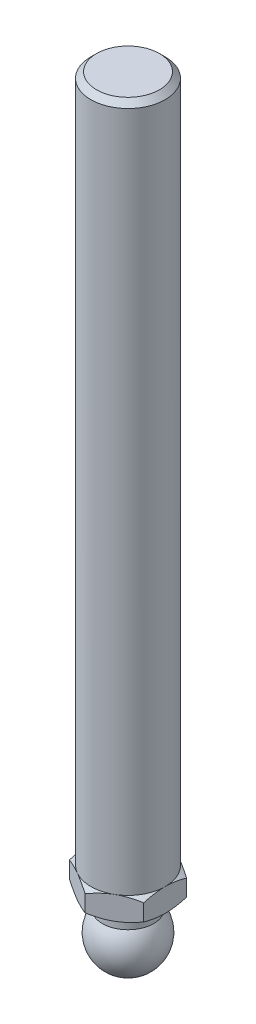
ISO-10303-21;
HEADER;
FILE_DESCRIPTION(('STEP AP214'),'2;1');
FILE_NAME('part.step','',(''),(''),'','','');
FILE_SCHEMA(('AUTOMOTIVE_DESIGN { 1 0 10303 214 1 1 1 1 }'));
ENDSEC;
DATA;
#1=APPLICATION_CONTEXT('core data for automotive mechanical design processes');
#2=APPLICATION_PROTOCOL_DEFINITION('international standard','automotive_design',2000,#1);
#3=PRODUCT_CONTEXT('',#1,'mechanical');
#4=PRODUCT('Part','Part','',(#3));
#5=PRODUCT_RELATED_PRODUCT_CATEGORY('part','',(#4));
#6=PRODUCT_DEFINITION_FORMATION('','',#4);
#7=PRODUCT_DEFINITION_CONTEXT('part definition',#1,'design');
#8=PRODUCT_DEFINITION('design','',#6,#7);
#9=PRODUCT_DEFINITION_SHAPE('','',#8);
#10=(LENGTH_UNIT() NAMED_UNIT(*) SI_UNIT(.MILLI.,.METRE.));
#11=(NAMED_UNIT(*) PLANE_ANGLE_UNIT() SI_UNIT($,.RADIAN.));
#12=(NAMED_UNIT(*) SI_UNIT($,.STERADIAN.) SOLID_ANGLE_UNIT());
#13=UNCERTAINTY_MEASURE_WITH_UNIT(LENGTH_MEASURE(1.E-05),#10,'distance_accuracy_value','');
#14=(GEOMETRIC_REPRESENTATION_CONTEXT(3) GLOBAL_UNCERTAINTY_ASSIGNED_CONTEXT((#13)) GLOBAL_UNIT_ASSIGNED_CONTEXT((#10,
#11,#12)) REPRESENTATION_CONTEXT('',''));
#15=CARTESIAN_POINT('',(0.,0.,0.));
#16=DIRECTION('',(0.,0.,1.));
#17=DIRECTION('',(1.,0.,0.));
#18=AXIS2_PLACEMENT_3D('',#15,#16,#17);
#19=CARTESIAN_POINT('',(0.,7.,0.));
#20=DIRECTION('',(0.,-1.,0.));
#21=DIRECTION('',(-1.,0.,0.));
#22=AXIS2_PLACEMENT_3D('',#19,#20,#21);
#23=SPHERICAL_SURFACE('',#22,7.);
#24=CARTESIAN_POINT('',(-9.71445146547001E-13,0.,0.));
#25=VERTEX_POINT('',#24);
#26=VERTEX_LOOP('',#25);
#27=FACE_BOUND('',#26,.T.);
#28=CARTESIAN_POINT('',(0.,11.3301270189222,0.));
#29=DIRECTION('',(0.,-1.,0.));
#30=DIRECTION('',(0.,0.,-1.));
#31=AXIS2_PLACEMENT_3D('',#28,#29,#30);
#32=CIRCLE('',#31,5.5);
#33=CARTESIAN_POINT('',(0.,11.3301270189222,-5.5));
#34=VERTEX_POINT('',#33);
#35=EDGE_CURVE('E9',#34,#34,#32,.T.);
#36=ORIENTED_EDGE('',*,*,#35,.T.);
#37=EDGE_LOOP('',(#36));
#38=FACE_BOUND('',#37,.T.);
#39=ADVANCED_FACE('F14',(#27,#38),#23,.T.);
#40=CARTESIAN_POINT('',(0.,0.,0.));
#41=DIRECTION('',(0.,-1.,0.));
#42=DIRECTION('',(0.,0.,-1.));
#43=AXIS2_PLACEMENT_3D('',#40,#41,#42);
#44=CYLINDRICAL_SURFACE('',#43,5.5);
#45=ORIENTED_EDGE('',*,*,#35,.F.);
#46=EDGE_LOOP('',(#45));
#47=FACE_BOUND('',#46,.T.);
#48=CARTESIAN_POINT('',(0.,14.5,0.));
#49=DIRECTION('',(0.,-1.,0.));
#50=DIRECTION('',(0.,0.,-1.));
#51=AXIS2_PLACEMENT_3D('',#48,#49,#50);
#52=CIRCLE('',#51,5.5);
#53=CARTESIAN_POINT('',(0.,14.5,-5.5));
#54=VERTEX_POINT('',#53);
#55=EDGE_CURVE('E146',#54,#54,#52,.T.);
#56=ORIENTED_EDGE('',*,*,#55,.T.);
#57=EDGE_LOOP('',(#56));
#58=FACE_BOUND('',#57,.T.);
#59=ADVANCED_FACE('F251',(#47,#58),#44,.T.);
#60=CARTESIAN_POINT('',(8.,14.5,0.));
#61=DIRECTION('',(0.,1.,0.));
#62=DIRECTION('',(0.,0.,1.));
#63=AXIS2_PLACEMENT_3D('',#60,#61,#62);
#64=PLANE('',#63);
#65=ORIENTED_EDGE('',*,*,#55,.F.);
#66=EDGE_LOOP('',(#65));
#67=FACE_BOUND('',#66,.T.);
#68=CARTESIAN_POINT('',(0.,14.5,0.));
#69=DIRECTION('',(0.,-1.,0.));
#70=DIRECTION('',(0.,0.,-1.));
#71=AXIS2_PLACEMENT_3D('',#68,#69,#70);
#72=CIRCLE('',#71,8.);
#73=CARTESIAN_POINT('',(4.,14.5,-6.92820323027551));
#74=VERTEX_POINT('',#73);
#75=CARTESIAN_POINT('',(8.,14.5,0.));
#76=VERTEX_POINT('',#75);
#77=EDGE_CURVE('E145',#74,#76,#72,.T.);
#78=ORIENTED_EDGE('',*,*,#77,.T.);
#79=CARTESIAN_POINT('',(4.,14.5,6.92820323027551));
#80=VERTEX_POINT('',#79);
#81=EDGE_CURVE('E141',#76,#80,#72,.T.);
#82=ORIENTED_EDGE('',*,*,#81,.T.);
#83=CARTESIAN_POINT('',(-4.,14.5,6.92820323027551));
#84=VERTEX_POINT('',#83);
#85=EDGE_CURVE('E144',#80,#84,#72,.T.);
#86=ORIENTED_EDGE('',*,*,#85,.T.);
#87=CARTESIAN_POINT('',(-8.,14.5,0.));
#88=VERTEX_POINT('',#87);
#89=EDGE_CURVE('E212',#84,#88,#72,.T.);
#90=ORIENTED_EDGE('',*,*,#89,.T.);
#91=CARTESIAN_POINT('',(-4.,14.5,-6.92820323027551));
#92=VERTEX_POINT('',#91);
#93=EDGE_CURVE('E215',#88,#92,#72,.T.);
#94=ORIENTED_EDGE('',*,*,#93,.T.);
#95=EDGE_CURVE('E220',#92,#74,#72,.T.);
#96=ORIENTED_EDGE('',*,*,#95,.T.);
#97=EDGE_LOOP('',(#78,#82,#86,#90,#94,#96));
#98=FACE_BOUND('',#97,.T.);
#99=ADVANCED_FACE('F222',(#67,#98),#64,.F.);
#100=CARTESIAN_POINT('',(0.,17.,0.));
#101=DIRECTION('',(0.,1.,0.));
#102=DIRECTION('',(0.,0.,1.));
#103=AXIS2_PLACEMENT_3D('',#100,#101,#102);
#104=CONICAL_SURFACE('',#103,12.3301270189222,1.0471975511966);
#105=CARTESIAN_POINT('',(-8.,19.285548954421,-14.1889203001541));
#106=CARTESIAN_POINT('',(-8.,19.1157216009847,-13.851186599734));
#107=CARTESIAN_POINT('',(-8.,18.9470198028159,-13.5128811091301));
#108=CARTESIAN_POINT('',(-8.,18.6124136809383,-12.8348638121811));
#109=CARTESIAN_POINT('',(-8.,18.446509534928,-12.4951519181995));
#110=CARTESIAN_POINT('',(-8.,18.1177477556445,-11.8134403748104));
#111=CARTESIAN_POINT('',(-8.,17.9548966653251,-11.4714375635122));
#112=CARTESIAN_POINT('',(-8.,17.6333333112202,-10.7854960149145));
#113=CARTESIAN_POINT('',(-8.,17.4746209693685,-10.4415573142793));
#114=CARTESIAN_POINT('',(-8.,17.1550497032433,-9.7353527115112));
#115=CARTESIAN_POINT('',(-8.,16.9944328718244,-9.37297690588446));
#116=CARTESIAN_POINT('',(-8.,16.680226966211,-8.64516064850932));
#117=CARTESIAN_POINT('',(-8.,16.5266382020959,-8.27972006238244));
#118=CARTESIAN_POINT('',(-8.,16.2285062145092,-7.54540420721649));
#119=CARTESIAN_POINT('',(-8.,16.0839575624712,-7.17653115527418));
#120=CARTESIAN_POINT('',(-8.,15.8063691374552,-6.43449862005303));
#121=CARTESIAN_POINT('',(-8.,15.6733281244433,-6.06133960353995));
#122=CARTESIAN_POINT('',(-8.,15.394180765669,-5.22677195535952));
#123=CARTESIAN_POINT('',(-8.,15.2517108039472,-4.7641292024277));
#124=CARTESIAN_POINT('',(-8.,14.9966536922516,-3.83044032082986));
#125=CARTESIAN_POINT('',(-8.,14.884064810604,-3.35939468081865));
#126=CARTESIAN_POINT('',(-8.,14.7453718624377,-2.65118427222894));
#127=CARTESIAN_POINT('',(-8.,14.7044045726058,-2.41690742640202));
#128=CARTESIAN_POINT('',(-8.,14.6329876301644,-1.94676929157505));
#129=CARTESIAN_POINT('',(-8.,14.6025364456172,-1.7109082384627));
#130=CARTESIAN_POINT('',(-8.,14.5530553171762,-1.23805721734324));
#131=CARTESIAN_POINT('',(-8.,14.5340217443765,-1.00106763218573));
#132=CARTESIAN_POINT('',(-8.,14.5079793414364,-0.52642336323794));
#133=CARTESIAN_POINT('',(-8.,14.500970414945,-0.288768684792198));
#134=CARTESIAN_POINT('',(-8.,14.4992116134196,0.188309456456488));
#135=CARTESIAN_POINT('',(-8.,14.5045509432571,0.427733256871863));
#136=CARTESIAN_POINT('',(-8.,14.5274871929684,0.905988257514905));
#137=CARTESIAN_POINT('',(-8.,14.5450842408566,1.1448194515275));
#138=CARTESIAN_POINT('',(-8.,14.5919591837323,1.62141631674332));
#139=CARTESIAN_POINT('',(-8.,14.6212415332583,1.85918154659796));
#140=CARTESIAN_POINT('',(-8.,14.6905925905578,2.33311174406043));
#141=CARTESIAN_POINT('',(-8.,14.7306614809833,2.56927668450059));
#142=CARTESIAN_POINT('',(-8.,14.8670437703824,3.28330816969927));
#143=CARTESIAN_POINT('',(-8.,14.9786420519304,3.75830022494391));
#144=CARTESIAN_POINT('',(-8.,15.169124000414,4.46428489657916));
#145=CARTESIAN_POINT('',(-8.,15.2364734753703,4.69855285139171));
#146=CARTESIAN_POINT('',(-8.,15.3778224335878,5.16507806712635));
#147=CARTESIAN_POINT('',(-8.,15.4518216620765,5.3973354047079));
#148=CARTESIAN_POINT('',(-8.,15.654376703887,6.0070580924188));
#149=CARTESIAN_POINT('',(-8.,15.7876997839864,6.38293491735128));
#150=CARTESIAN_POINT('',(-8.,16.0661205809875,7.13030495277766));
#151=CARTESIAN_POINT('',(-8.,16.2112196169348,7.50179766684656));
#152=CARTESIAN_POINT('',(-8.,16.5106611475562,8.2412884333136));
#153=CARTESIAN_POINT('',(-8.,16.6650093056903,8.60928418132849));
#154=CARTESIAN_POINT('',(-8.,16.9808780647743,9.34215095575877));
#155=CARTESIAN_POINT('',(-8.,17.1423983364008,9.7070221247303));
#156=CARTESIAN_POINT('',(-8.,17.4637771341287,10.4179250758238));
#157=CARTESIAN_POINT('',(-8.,17.6233869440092,10.7640696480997));
#158=CARTESIAN_POINT('',(-8.,17.9468132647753,11.4543922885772));
#159=CARTESIAN_POINT('',(-8.,18.1106298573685,11.7985703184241));
#160=CARTESIAN_POINT('',(-8.,18.441361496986,12.4845836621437));
#161=CARTESIAN_POINT('',(-8.,18.6082696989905,12.8264222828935));
#162=CARTESIAN_POINT('',(-8.,18.9449220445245,13.5086735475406));
#163=CARTESIAN_POINT('',(-8.,19.1146660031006,13.8490862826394));
#164=CARTESIAN_POINT('',(-8.,19.285548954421,14.1889203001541));
#165=B_SPLINE_CURVE_WITH_KNOTS('',3,(#105,#106,#107,#108,#109,#110,#111,#112,#113,#114,#115,
#116,#117,#118,#119,#120,#121,#122,#123,#124,#125,#126,#127,#128,#129,#130,#131,#132,#133,#134,
#135,#136,#137,#138,#139,#140,#141,#142,#143,#144,#145,#146,#147,#148,#149,#150,#151,#152,#153,
#154,#155,#156,#157,#158,#159,#160,#161,#162,#163,#164),.UNSPECIFIED.,.F.,.F.,(4,2,2,2,2,2,2,2,
2,2,2,2,2,2,2,2,2,2,2,2,2,2,2,2,2,2,2,2,2,4),(0.,1.13409047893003,2.2682527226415,
3.40461779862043,4.54096142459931,5.7300307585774,6.91915250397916,8.1075531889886,
9.29582565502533,10.7473798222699,12.1988498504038,12.9121466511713,13.6253394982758,
14.3383055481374,15.0512658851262,15.7693927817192,16.4875271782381,17.2059355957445,
17.9243561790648,19.3864869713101,20.1177019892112,20.8488890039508,22.0450800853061,
23.2414053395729,24.4384707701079,25.6354812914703,26.7789606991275,27.9224623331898,
29.063679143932,30.2048218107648),.UNSPECIFIED.);
#166=CARTESIAN_POINT('',(-8.,15.2145311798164,4.61880215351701));
#167=VERTEX_POINT('',#166);
#168=EDGE_CURVE('E157',#88,#167,#165,.T.);
#169=ORIENTED_EDGE('',*,*,#168,.F.);
#170=ORIENTED_EDGE('',*,*,#89,.F.);
#171=CARTESIAN_POINT('',(-8.0002,15.214597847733,4.61868668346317));
#172=CARTESIAN_POINT('',(-7.82435121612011,15.1559907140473,4.7202130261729));
#173=CARTESIAN_POINT('',(-7.64784680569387,15.1000434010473,4.82211789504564));
#174=CARTESIAN_POINT('',(-7.29340453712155,14.9942010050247,5.02675523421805));
#175=CARTESIAN_POINT('',(-7.11546609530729,14.9443085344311,5.1294880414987));
#176=CARTESIAN_POINT('',(-6.57880176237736,14.8046927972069,5.43933133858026));
#177=CARTESIAN_POINT('',(-6.21795741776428,14.7252811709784,5.64766491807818));
#178=CARTESIAN_POINT('',(-5.67796082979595,14.6321616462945,5.95943209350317));
#179=CARTESIAN_POINT('',(-5.50042181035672,14.6056345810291,6.06193429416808));
#180=CARTESIAN_POINT('',(-5.1445408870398,14.5611531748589,6.26740224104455));
#181=CARTESIAN_POINT('',(-4.96619905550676,14.5431980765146,6.37036794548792));
#182=CARTESIAN_POINT('',(-4.60920831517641,14.5163156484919,6.57647664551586));
#183=CARTESIAN_POINT('',(-4.4305599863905,14.5073780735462,6.67961930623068));
#184=CARTESIAN_POINT('',(-4.07309829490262,14.4987223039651,6.88599991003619));
#185=CARTESIAN_POINT('',(-3.89428493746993,14.4990038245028,6.98923785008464));
#186=CARTESIAN_POINT('',(-3.55998663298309,14.5081450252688,7.18224506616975));
#187=CARTESIAN_POINT('',(-3.40447809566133,14.5158896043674,7.27202796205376));
#188=CARTESIAN_POINT('',(-3.09382523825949,14.5382011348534,7.45138347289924));
#189=CARTESIAN_POINT('',(-2.93868094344,14.5527685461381,7.54095607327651));
#190=CARTESIAN_POINT('',(-2.47384868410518,14.6063606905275,7.80932710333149));
#191=CARTESIAN_POINT('',(-2.16498351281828,14.6552686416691,7.98765049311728));
#192=CARTESIAN_POINT('',(-1.5439767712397,14.7775394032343,8.34618890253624));
#193=CARTESIAN_POINT('',(-1.23191445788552,14.851420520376,8.52635816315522));
#194=CARTESIAN_POINT('',(-0.612443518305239,15.019100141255,8.88400987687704));
#195=CARTESIAN_POINT('',(-0.305026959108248,15.1128592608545,9.06149691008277));
#196=CARTESIAN_POINT('',(0.000200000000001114,15.214597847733,9.23771977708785));
#197=B_SPLINE_CURVE_WITH_KNOTS('',3,(#171,#172,#173,#174,#175,#176,#177,#178,#179,#180,#181,
#182,#183,#184,#185,#186,#187,#188,#189,#190,#191,#192,#193,#194,#195,#196),.UNSPECIFIED.,.F.,
.F.,(4,2,2,2,2,2,2,2,2,2,2,2,4),(0.,0.633973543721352,1.26821965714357,2.53934712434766,
3.1593434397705,3.77928496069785,4.39852133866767,5.01773858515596,5.5568023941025,
6.09590254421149,7.17487077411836,8.27776850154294,9.37850115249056),.UNSPECIFIED.);
#198=EDGE_CURVE('E120',#167,#84,#197,.T.);
#199=ORIENTED_EDGE('',*,*,#198,.F.);
#200=EDGE_LOOP('',(#169,#170,#199));
#201=FACE_BOUND('',#200,.T.);
#202=ADVANCED_FACE('F210',(#201),#104,.T.);
#203=CARTESIAN_POINT('',(0.0002,15.214597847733,-9.23771977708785));
#204=CARTESIAN_POINT('',(-0.175648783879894,15.1559907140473,-9.13619343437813));
#205=CARTESIAN_POINT('',(-0.352153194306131,15.1000434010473,-9.03428856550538));
#206=CARTESIAN_POINT('',(-0.706595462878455,14.9942010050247,-8.82965122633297));
#207=CARTESIAN_POINT('',(-0.884533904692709,14.9443085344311,-8.72691841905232));
#208=CARTESIAN_POINT('',(-1.42119823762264,14.8046927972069,-8.41707512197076));
#209=CARTESIAN_POINT('',(-1.78204258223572,14.7252811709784,-8.20874154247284));
#210=CARTESIAN_POINT('',(-2.32203917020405,14.6321616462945,-7.89697436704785));
#211=CARTESIAN_POINT('',(-2.49957818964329,14.6056345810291,-7.79447216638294));
#212=CARTESIAN_POINT('',(-2.8554591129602,14.5611531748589,-7.58900421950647));
#213=CARTESIAN_POINT('',(-3.03380094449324,14.5431980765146,-7.4860385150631));
#214=CARTESIAN_POINT('',(-3.39079168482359,14.5163156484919,-7.27992981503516));
#215=CARTESIAN_POINT('',(-3.5694400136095,14.5073780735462,-7.17678715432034));
#216=CARTESIAN_POINT('',(-3.92690170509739,14.4987223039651,-6.97040655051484));
#217=CARTESIAN_POINT('',(-4.10571506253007,14.4990038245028,-6.86716861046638));
#218=CARTESIAN_POINT('',(-4.44001336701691,14.5081450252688,-6.67416139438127));
#219=CARTESIAN_POINT('',(-4.59552190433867,14.5158896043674,-6.58437849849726));
#220=CARTESIAN_POINT('',(-4.90617476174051,14.5382011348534,-6.40502298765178));
#221=CARTESIAN_POINT('',(-5.06131905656,14.5527685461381,-6.31545038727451));
#222=CARTESIAN_POINT('',(-5.52615131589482,14.6063606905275,-6.04707935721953));
#223=CARTESIAN_POINT('',(-5.83501648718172,14.6552686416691,-5.86875596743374));
#224=CARTESIAN_POINT('',(-6.4560232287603,14.7775394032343,-5.51021755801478));
#225=CARTESIAN_POINT('',(-6.76808554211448,14.851420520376,-5.3300482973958));
#226=CARTESIAN_POINT('',(-7.38755648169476,15.019100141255,-4.97239658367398));
#227=CARTESIAN_POINT('',(-7.69497304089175,15.1128592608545,-4.79490955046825));
#228=CARTESIAN_POINT('',(-8.0002,15.214597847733,-4.61868668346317));
#229=B_SPLINE_CURVE_WITH_KNOTS('',3,(#203,#204,#205,#206,#207,#208,#209,#210,#211,#212,#213,
#214,#215,#216,#217,#218,#219,#220,#221,#222,#223,#224,#225,#226,#227,#228),.UNSPECIFIED.,.F.,
.F.,(4,2,2,2,2,2,2,2,2,2,2,2,4),(0.,0.633973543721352,1.26821965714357,2.53934712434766,
3.1593434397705,3.77928496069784,4.39852133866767,5.01773858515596,5.5568023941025,
6.09590254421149,7.17487077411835,8.27776850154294,9.37850115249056),.UNSPECIFIED.);
#230=CARTESIAN_POINT('',(-8.,15.2145311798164,-4.61880215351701));
#231=VERTEX_POINT('',#230);
#232=EDGE_CURVE('E182',#92,#231,#229,.T.);
#233=ORIENTED_EDGE('',*,*,#232,.F.);
#234=ORIENTED_EDGE('',*,*,#93,.F.);
#235=EDGE_CURVE('E156',#231,#88,#165,.T.);
#236=ORIENTED_EDGE('',*,*,#235,.F.);
#237=EDGE_LOOP('',(#233,#234,#236));
#238=FACE_BOUND('',#237,.T.);
#239=ADVANCED_FACE('F216',(#238),#104,.T.);
#240=CARTESIAN_POINT('',(8.0002,15.214597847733,-4.61868668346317));
#241=CARTESIAN_POINT('',(7.82435121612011,15.1559907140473,-4.7202130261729));
#242=CARTESIAN_POINT('',(7.64784680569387,15.1000434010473,-4.82211789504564));
#243=CARTESIAN_POINT('',(7.29340453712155,14.9942010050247,-5.02675523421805));
#244=CARTESIAN_POINT('',(7.11546609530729,14.9443085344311,-5.1294880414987));
#245=CARTESIAN_POINT('',(6.57880176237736,14.8046927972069,-5.43933133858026));
#246=CARTESIAN_POINT('',(6.21795741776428,14.7252811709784,-5.64766491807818));
#247=CARTESIAN_POINT('',(5.67796082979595,14.6321616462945,-5.95943209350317));
#248=CARTESIAN_POINT('',(5.50042181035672,14.6056345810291,-6.06193429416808));
#249=CARTESIAN_POINT('',(5.1445408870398,14.5611531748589,-6.26740224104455));
#250=CARTESIAN_POINT('',(4.96619905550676,14.5431980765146,-6.37036794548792));
#251=CARTESIAN_POINT('',(4.60920831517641,14.5163156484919,-6.57647664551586));
#252=CARTESIAN_POINT('',(4.4305599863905,14.5073780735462,-6.67961930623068));
#253=CARTESIAN_POINT('',(4.07309829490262,14.4987223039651,-6.88599991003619));
#254=CARTESIAN_POINT('',(3.89428493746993,14.4990038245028,-6.98923785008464));
#255=CARTESIAN_POINT('',(3.55998663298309,14.5081450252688,-7.18224506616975));
#256=CARTESIAN_POINT('',(3.40447809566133,14.5158896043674,-7.27202796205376));
#257=CARTESIAN_POINT('',(3.09382523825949,14.5382011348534,-7.45138347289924));
#258=CARTESIAN_POINT('',(2.93868094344,14.5527685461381,-7.54095607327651));
#259=CARTESIAN_POINT('',(2.47384868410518,14.6063606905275,-7.80932710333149));
#260=CARTESIAN_POINT('',(2.16498351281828,14.6552686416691,-7.98765049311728));
#261=CARTESIAN_POINT('',(1.5439767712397,14.7775394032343,-8.34618890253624));
#262=CARTESIAN_POINT('',(1.23191445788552,14.851420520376,-8.52635816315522));
#263=CARTESIAN_POINT('',(0.612443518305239,15.019100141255,-8.88400987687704));
#264=CARTESIAN_POINT('',(0.305026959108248,15.1128592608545,-9.06149691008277));
#265=CARTESIAN_POINT('',(-0.000200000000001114,15.214597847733,-9.23771977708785));
#266=B_SPLINE_CURVE_WITH_KNOTS('',3,(#240,#241,#242,#243,#244,#245,#246,#247,#248,#249,#250,
#251,#252,#253,#254,#255,#256,#257,#258,#259,#260,#261,#262,#263,#264,#265),.UNSPECIFIED.,.F.,
.F.,(4,2,2,2,2,2,2,2,2,2,2,2,4),(0.,0.633973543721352,1.26821965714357,2.53934712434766,
3.1593434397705,3.77928496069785,4.39852133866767,5.01773858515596,5.5568023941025,
6.09590254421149,7.17487077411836,8.27776850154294,9.37850115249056),.UNSPECIFIED.);
#267=CARTESIAN_POINT('',(0.,15.2145311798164,-9.23760430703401));
#268=VERTEX_POINT('',#267);
#269=EDGE_CURVE('E285',#74,#268,#266,.T.);
#270=ORIENTED_EDGE('',*,*,#269,.F.);
#271=ORIENTED_EDGE('',*,*,#95,.F.);
#272=EDGE_CURVE('E193',#268,#92,#229,.T.);
#273=ORIENTED_EDGE('',*,*,#272,.F.);
#274=EDGE_LOOP('',(#270,#271,#273));
#275=FACE_BOUND('',#274,.T.);
#276=ADVANCED_FACE('F305',(#275),#104,.T.);
#277=CARTESIAN_POINT('',(-0.0002,15.214597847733,9.23771977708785));
#278=CARTESIAN_POINT('',(0.175648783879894,15.1559907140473,9.13619343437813));
#279=CARTESIAN_POINT('',(0.352153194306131,15.1000434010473,9.03428856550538));
#280=CARTESIAN_POINT('',(0.706595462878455,14.9942010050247,8.82965122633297));
#281=CARTESIAN_POINT('',(0.884533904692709,14.9443085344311,8.72691841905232));
#282=CARTESIAN_POINT('',(1.42119823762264,14.8046927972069,8.41707512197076));
#283=CARTESIAN_POINT('',(1.78204258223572,14.7252811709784,8.20874154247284));
#284=CARTESIAN_POINT('',(2.32203917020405,14.6321616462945,7.89697436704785));
#285=CARTESIAN_POINT('',(2.49957818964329,14.6056345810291,7.79447216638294));
#286=CARTESIAN_POINT('',(2.8554591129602,14.5611531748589,7.58900421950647));
#287=CARTESIAN_POINT('',(3.03380094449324,14.5431980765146,7.4860385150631));
#288=CARTESIAN_POINT('',(3.39079168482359,14.5163156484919,7.27992981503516));
#289=CARTESIAN_POINT('',(3.5694400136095,14.5073780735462,7.17678715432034));
#290=CARTESIAN_POINT('',(3.92690170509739,14.4987223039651,6.97040655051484));
#291=CARTESIAN_POINT('',(4.10571506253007,14.4990038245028,6.86716861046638));
#292=CARTESIAN_POINT('',(4.44001336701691,14.5081450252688,6.67416139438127));
#293=CARTESIAN_POINT('',(4.59552190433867,14.5158896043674,6.58437849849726));
#294=CARTESIAN_POINT('',(4.90617476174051,14.5382011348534,6.40502298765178));
#295=CARTESIAN_POINT('',(5.06131905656,14.5527685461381,6.31545038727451));
#296=CARTESIAN_POINT('',(5.52615131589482,14.6063606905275,6.04707935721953));
#297=CARTESIAN_POINT('',(5.83501648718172,14.6552686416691,5.86875596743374));
#298=CARTESIAN_POINT('',(6.4560232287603,14.7775394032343,5.51021755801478));
#299=CARTESIAN_POINT('',(6.76808554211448,14.851420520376,5.3300482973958));
#300=CARTESIAN_POINT('',(7.38755648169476,15.019100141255,4.97239658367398));
#301=CARTESIAN_POINT('',(7.69497304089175,15.1128592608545,4.79490955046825));
#302=CARTESIAN_POINT('',(8.0002,15.214597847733,4.61868668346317));
#303=B_SPLINE_CURVE_WITH_KNOTS('',3,(#277,#278,#279,#280,#281,#282,#283,#284,#285,#286,#287,
#288,#289,#290,#291,#292,#293,#294,#295,#296,#297,#298,#299,#300,#301,#302),.UNSPECIFIED.,.F.,
.F.,(4,2,2,2,2,2,2,2,2,2,2,2,4),(0.,0.633973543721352,1.26821965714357,2.53934712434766,
3.1593434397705,3.77928496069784,4.39852133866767,5.01773858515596,5.5568023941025,
6.09590254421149,7.17487077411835,8.27776850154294,9.37850115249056),.UNSPECIFIED.);
#304=CARTESIAN_POINT('',(0.,15.2145311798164,9.23760430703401));
#305=VERTEX_POINT('',#304);
#306=EDGE_CURVE('E228',#305,#80,#303,.T.);
#307=ORIENTED_EDGE('',*,*,#306,.F.);
#308=EDGE_CURVE('E31',#84,#305,#197,.T.);
#309=ORIENTED_EDGE('',*,*,#308,.F.);
#310=ORIENTED_EDGE('',*,*,#85,.F.);
#311=EDGE_LOOP('',(#307,#309,#310));
#312=FACE_BOUND('',#311,.T.);
#313=ADVANCED_FACE('F227',(#312),#104,.T.);
#314=CARTESIAN_POINT('',(8.,15.2145311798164,-4.61880215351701));
#315=VERTEX_POINT('',#314);
#316=EDGE_CURVE('E290',#315,#74,#266,.T.);
#317=ORIENTED_EDGE('',*,*,#316,.F.);
#318=CARTESIAN_POINT('',(8.,19.285548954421,14.1889203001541));
#319=CARTESIAN_POINT('',(8.,19.1157216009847,13.851186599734));
#320=CARTESIAN_POINT('',(8.,18.9470198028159,13.5128811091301));
#321=CARTESIAN_POINT('',(8.,18.6124136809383,12.8348638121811));
#322=CARTESIAN_POINT('',(8.,18.446509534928,12.4951519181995));
#323=CARTESIAN_POINT('',(8.,18.1177477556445,11.8134403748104));
#324=CARTESIAN_POINT('',(8.,17.9548966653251,11.4714375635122));
#325=CARTESIAN_POINT('',(8.,17.6333333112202,10.7854960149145));
#326=CARTESIAN_POINT('',(8.,17.4746209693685,10.4415573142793));
#327=CARTESIAN_POINT('',(8.,17.1550497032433,9.7353527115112));
#328=CARTESIAN_POINT('',(8.,16.9944328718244,9.37297690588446));
#329=CARTESIAN_POINT('',(8.,16.680226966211,8.64516064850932));
#330=CARTESIAN_POINT('',(8.,16.5266382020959,8.27972006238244));
#331=CARTESIAN_POINT('',(8.,16.2285062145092,7.54540420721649));
#332=CARTESIAN_POINT('',(8.,16.0839575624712,7.17653115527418));
#333=CARTESIAN_POINT('',(8.,15.8063691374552,6.43449862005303));
#334=CARTESIAN_POINT('',(8.,15.6733281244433,6.06133960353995));
#335=CARTESIAN_POINT('',(8.,15.394180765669,5.22677195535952));
#336=CARTESIAN_POINT('',(8.,15.2517108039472,4.7641292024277));
#337=CARTESIAN_POINT('',(8.,14.9966536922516,3.83044032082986));
#338=CARTESIAN_POINT('',(8.,14.884064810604,3.35939468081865));
#339=CARTESIAN_POINT('',(8.,14.7453718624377,2.65118427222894));
#340=CARTESIAN_POINT('',(8.,14.7044045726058,2.41690742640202));
#341=CARTESIAN_POINT('',(8.,14.6329876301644,1.94676929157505));
#342=CARTESIAN_POINT('',(8.,14.6025364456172,1.7109082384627));
#343=CARTESIAN_POINT('',(8.,14.5530553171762,1.23805721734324));
#344=CARTESIAN_POINT('',(8.,14.5340217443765,1.00106763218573));
#345=CARTESIAN_POINT('',(8.,14.5079793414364,0.52642336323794));
#346=CARTESIAN_POINT('',(8.,14.500970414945,0.288768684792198));
#347=CARTESIAN_POINT('',(8.,14.4992116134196,-0.188309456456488));
#348=CARTESIAN_POINT('',(8.,14.5045509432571,-0.427733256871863));
#349=CARTESIAN_POINT('',(8.,14.5274871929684,-0.905988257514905));
#350=CARTESIAN_POINT('',(8.,14.5450842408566,-1.1448194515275));
#351=CARTESIAN_POINT('',(8.,14.5919591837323,-1.62141631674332));
#352=CARTESIAN_POINT('',(8.,14.6212415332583,-1.85918154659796));
#353=CARTESIAN_POINT('',(8.,14.6905925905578,-2.33311174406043));
#354=CARTESIAN_POINT('',(8.,14.7306614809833,-2.56927668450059));
#355=CARTESIAN_POINT('',(8.,14.8670437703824,-3.28330816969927));
#356=CARTESIAN_POINT('',(8.,14.9786420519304,-3.75830022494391));
#357=CARTESIAN_POINT('',(8.,15.169124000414,-4.46428489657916));
#358=CARTESIAN_POINT('',(8.,15.2364734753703,-4.69855285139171));
#359=CARTESIAN_POINT('',(8.,15.3778224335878,-5.16507806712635));
#360=CARTESIAN_POINT('',(8.,15.4518216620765,-5.3973354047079));
#361=CARTESIAN_POINT('',(8.,15.654376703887,-6.0070580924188));
#362=CARTESIAN_POINT('',(8.,15.7876997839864,-6.38293491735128));
#363=CARTESIAN_POINT('',(8.,16.0661205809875,-7.13030495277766));
#364=CARTESIAN_POINT('',(8.,16.2112196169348,-7.50179766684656));
#365=CARTESIAN_POINT('',(8.,16.5106611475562,-8.2412884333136));
#366=CARTESIAN_POINT('',(8.,16.6650093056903,-8.60928418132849));
#367=CARTESIAN_POINT('',(8.,16.9808780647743,-9.34215095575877));
#368=CARTESIAN_POINT('',(8.,17.1423983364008,-9.7070221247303));
#369=CARTESIAN_POINT('',(8.,17.4637771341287,-10.4179250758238));
#370=CARTESIAN_POINT('',(8.,17.6233869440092,-10.7640696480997));
#371=CARTESIAN_POINT('',(8.,17.9468132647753,-11.4543922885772));
#372=CARTESIAN_POINT('',(8.,18.1106298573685,-11.7985703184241));
#373=CARTESIAN_POINT('',(8.,18.441361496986,-12.4845836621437));
#374=CARTESIAN_POINT('',(8.,18.6082696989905,-12.8264222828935));
#375=CARTESIAN_POINT('',(8.,18.9449220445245,-13.5086735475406));
#376=CARTESIAN_POINT('',(8.,19.1146660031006,-13.8490862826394));
#377=CARTESIAN_POINT('',(8.,19.285548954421,-14.1889203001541));
#378=B_SPLINE_CURVE_WITH_KNOTS('',3,(#318,#319,#320,#321,#322,#323,#324,#325,#326,#327,#328,
#329,#330,#331,#332,#333,#334,#335,#336,#337,#338,#339,#340,#341,#342,#343,#344,#345,#346,#347,
#348,#349,#350,#351,#352,#353,#354,#355,#356,#357,#358,#359,#360,#361,#362,#363,#364,#365,#366,
#367,#368,#369,#370,#371,#372,#373,#374,#375,#376,#377),.UNSPECIFIED.,.F.,.F.,(4,2,2,2,2,2,2,2,
2,2,2,2,2,2,2,2,2,2,2,2,2,2,2,2,2,2,2,2,2,4),(0.,1.13409047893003,2.2682527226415,
3.40461779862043,4.54096142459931,5.7300307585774,6.91915250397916,8.1075531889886,
9.29582565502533,10.7473798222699,12.1988498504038,12.9121466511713,13.6253394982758,
14.3383055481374,15.0512658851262,15.7693927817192,16.4875271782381,17.2059355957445,
17.9243561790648,19.3864869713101,20.1177019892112,20.8488890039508,22.0450800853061,
23.2414053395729,24.4384707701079,25.6354812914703,26.7789606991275,27.9224623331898,
29.063679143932,30.2048218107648),.UNSPECIFIED.);
#379=EDGE_CURVE('E271',#76,#315,#378,.T.);
#380=ORIENTED_EDGE('',*,*,#379,.F.);
#381=ORIENTED_EDGE('',*,*,#77,.F.);
#382=EDGE_LOOP('',(#317,#380,#381));
#383=FACE_BOUND('',#382,.T.);
#384=ADVANCED_FACE('F243',(#383),#104,.T.);
#385=CARTESIAN_POINT('',(8.,15.2145311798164,4.61880215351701));
#386=VERTEX_POINT('',#385);
#387=EDGE_CURVE('E277',#386,#76,#378,.T.);
#388=ORIENTED_EDGE('',*,*,#387,.F.);
#389=EDGE_CURVE('E111',#80,#386,#303,.T.);
#390=ORIENTED_EDGE('',*,*,#389,.F.);
#391=ORIENTED_EDGE('',*,*,#81,.F.);
#392=EDGE_LOOP('',(#388,#390,#391));
#393=FACE_BOUND('',#392,.T.);
#394=ADVANCED_FACE('F250',(#393),#104,.T.);
#395=CARTESIAN_POINT('',(-8.,14.3,4.61880215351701));
#396=DIRECTION('',(-0.5,0.,0.866025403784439));
#397=DIRECTION('',(0.866025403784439,0.,0.5));
#398=AXIS2_PLACEMENT_3D('',#395,#396,#397);
#399=PLANE('',#398);
#400=CARTESIAN_POINT('',(0.0002,18.7854021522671,9.23771977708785));
#401=CARTESIAN_POINT('',(-0.175648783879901,18.8440092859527,9.13619343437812));
#402=CARTESIAN_POINT('',(-0.352153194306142,18.8999565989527,9.03428856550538));
#403=CARTESIAN_POINT('',(-0.706595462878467,19.0057989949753,8.82965122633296));
#404=CARTESIAN_POINT('',(-0.884533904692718,19.0556914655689,8.72691841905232));
#405=CARTESIAN_POINT('',(-1.42119823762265,19.1953072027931,8.41707512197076));
#406=CARTESIAN_POINT('',(-1.78204258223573,19.2747188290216,8.20874154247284));
#407=CARTESIAN_POINT('',(-2.32203917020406,19.3678383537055,7.89697436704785));
#408=CARTESIAN_POINT('',(-2.49957818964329,19.3943654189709,7.79447216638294));
#409=CARTESIAN_POINT('',(-2.85545911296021,19.4388468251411,7.58900421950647));
#410=CARTESIAN_POINT('',(-3.03380094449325,19.4568019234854,7.4860385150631));
#411=CARTESIAN_POINT('',(-3.3907916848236,19.4836843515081,7.27992981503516));
#412=CARTESIAN_POINT('',(-3.56944001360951,19.4926219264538,7.17678715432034));
#413=CARTESIAN_POINT('',(-3.92690170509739,19.5012776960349,6.97040655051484));
#414=CARTESIAN_POINT('',(-4.10571506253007,19.5009961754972,6.86716861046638));
#415=CARTESIAN_POINT('',(-4.44001336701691,19.4918549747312,6.67416139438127));
#416=CARTESIAN_POINT('',(-4.59552190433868,19.4841103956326,6.58437849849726));
#417=CARTESIAN_POINT('',(-4.90617476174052,19.4617988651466,6.40502298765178));
#418=CARTESIAN_POINT('',(-5.06131905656,19.4472314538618,6.31545038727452));
#419=CARTESIAN_POINT('',(-5.52615131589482,19.3936393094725,6.04707935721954));
#420=CARTESIAN_POINT('',(-5.83501648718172,19.3447313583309,5.86875596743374));
#421=CARTESIAN_POINT('',(-6.4560232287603,19.2224605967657,5.51021755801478));
#422=CARTESIAN_POINT('',(-6.76808554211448,19.148579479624,5.33004829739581));
#423=CARTESIAN_POINT('',(-7.38755648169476,18.980899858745,4.97239658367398));
#424=CARTESIAN_POINT('',(-7.69497304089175,18.8871407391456,4.79490955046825));
#425=CARTESIAN_POINT('',(-8.0002,18.7854021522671,4.61868668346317));
#426=B_SPLINE_CURVE_WITH_KNOTS('',3,(#400,#401,#402,#403,#404,#405,#406,#407,#408,#409,#410,
#411,#412,#413,#414,#415,#416,#417,#418,#419,#420,#421,#422,#423,#424,#425),.UNSPECIFIED.,.F.,
.F.,(4,2,2,2,2,2,2,2,2,2,2,2,4),(0.,0.633973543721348,1.26821965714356,2.53934712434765,
3.15934343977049,3.77928496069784,4.39852133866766,5.01773858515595,5.55680239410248,
6.09590254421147,7.17487077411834,8.27776850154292,9.37850115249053),.UNSPECIFIED.);
#427=CARTESIAN_POINT('',(0.,18.7854688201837,9.23760430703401));
#428=VERTEX_POINT('',#427);
#429=CARTESIAN_POINT('',(-4.,19.5,6.92820323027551));
#430=VERTEX_POINT('',#429);
#431=EDGE_CURVE('E101',#428,#430,#426,.T.);
#432=ORIENTED_EDGE('',*,*,#431,.T.);
#433=CARTESIAN_POINT('',(-8.,18.7854688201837,4.61880215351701));
#434=VERTEX_POINT('',#433);
#435=EDGE_CURVE('E105',#430,#434,#426,.T.);
#436=ORIENTED_EDGE('',*,*,#435,.T.);
#437=DIRECTION('',(0.,1.,0.));
#438=VECTOR('',#437,1.);
#439=CARTESIAN_POINT('',(-8.,14.3,4.61880215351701));
#440=LINE('',#439,#438);
#441=EDGE_CURVE('E21',#167,#434,#440,.T.);
#442=ORIENTED_EDGE('',*,*,#441,.F.);
#443=ORIENTED_EDGE('',*,*,#198,.T.);
#444=ORIENTED_EDGE('',*,*,#308,.T.);
#445=DIRECTION('',(0.,1.,0.));
#446=VECTOR('',#445,1.);
#447=CARTESIAN_POINT('',(0.,14.3,9.23760430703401));
#448=LINE('',#447,#446);
#449=EDGE_CURVE('E107',#305,#428,#448,.T.);
#450=ORIENTED_EDGE('',*,*,#449,.T.);
#451=EDGE_LOOP('',(#432,#436,#442,#443,#444,#450));
#452=FACE_BOUND('',#451,.T.);
#453=ADVANCED_FACE('F103',(#452),#399,.T.);
#454=CARTESIAN_POINT('',(-8.,14.3,-4.61880215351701));
#455=DIRECTION('',(-1.,0.,0.));
#456=DIRECTION('',(0.,0.,1.));
#457=AXIS2_PLACEMENT_3D('',#454,#455,#456);
#458=PLANE('',#457);
#459=CARTESIAN_POINT('',(-8.,14.714451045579,14.1889203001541));
#460=CARTESIAN_POINT('',(-8.,14.8842783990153,13.851186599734));
#461=CARTESIAN_POINT('',(-8.,15.0529801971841,13.5128811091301));
#462=CARTESIAN_POINT('',(-8.,15.3875863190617,12.8348638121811));
#463=CARTESIAN_POINT('',(-8.,15.553490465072,12.4951519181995));
#464=CARTESIAN_POINT('',(-8.,15.8822522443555,11.8134403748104));
#465=CARTESIAN_POINT('',(-8.,16.0451033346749,11.4714375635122));
#466=CARTESIAN_POINT('',(-8.,16.3666666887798,10.7854960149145));
#467=CARTESIAN_POINT('',(-8.,16.5253790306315,10.4415573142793));
#468=CARTESIAN_POINT('',(-8.,16.8449502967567,9.73535271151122));
#469=CARTESIAN_POINT('',(-8.,17.0055671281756,9.37297690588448));
#470=CARTESIAN_POINT('',(-8.,17.3197730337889,8.64516064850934));
#471=CARTESIAN_POINT('',(-8.,17.4733617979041,8.27972006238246));
#472=CARTESIAN_POINT('',(-8.,17.7714937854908,7.54540420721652));
#473=CARTESIAN_POINT('',(-8.,17.9160424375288,7.1765311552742));
#474=CARTESIAN_POINT('',(-8.,18.1936308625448,6.43449862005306));
#475=CARTESIAN_POINT('',(-8.,18.3266718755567,6.06133960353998));
#476=CARTESIAN_POINT('',(-8.,18.605819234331,5.22677195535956));
#477=CARTESIAN_POINT('',(-8.,18.7482891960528,4.76412920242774));
#478=CARTESIAN_POINT('',(-8.,19.0033463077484,3.83044032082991));
#479=CARTESIAN_POINT('',(-8.,19.115935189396,3.3593946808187));
#480=CARTESIAN_POINT('',(-8.,19.2546281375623,2.651184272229));
#481=CARTESIAN_POINT('',(-8.,19.2955954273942,2.41690742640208));
#482=CARTESIAN_POINT('',(-8.,19.3670123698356,1.94676929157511));
#483=CARTESIAN_POINT('',(-8.,19.3974635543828,1.71090823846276));
#484=CARTESIAN_POINT('',(-8.,19.4469446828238,1.23805721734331));
#485=CARTESIAN_POINT('',(-8.,19.4659782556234,1.0010676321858));
#486=CARTESIAN_POINT('',(-8.,19.4920206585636,0.526423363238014));
#487=CARTESIAN_POINT('',(-8.,19.499029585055,0.288768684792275));
#488=CARTESIAN_POINT('',(-8.,19.5007883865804,-0.188309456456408));
#489=CARTESIAN_POINT('',(-8.,19.4954490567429,-0.427733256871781));
#490=CARTESIAN_POINT('',(-8.,19.4725128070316,-0.905988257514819));
#491=CARTESIAN_POINT('',(-8.,19.4549157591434,-1.14481945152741));
#492=CARTESIAN_POINT('',(-8.,19.4080408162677,-1.62141631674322));
#493=CARTESIAN_POINT('',(-8.,19.3787584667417,-1.85918154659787));
#494=CARTESIAN_POINT('',(-8.,19.3094074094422,-2.33311174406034));
#495=CARTESIAN_POINT('',(-8.,19.2693385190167,-2.56927668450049));
#496=CARTESIAN_POINT('',(-8.,19.1329562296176,-3.28330816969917));
#497=CARTESIAN_POINT('',(-8.,19.0213579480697,-3.75830022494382));
#498=CARTESIAN_POINT('',(-8.,18.830875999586,-4.46428489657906));
#499=CARTESIAN_POINT('',(-8.,18.7635265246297,-4.69855285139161));
#500=CARTESIAN_POINT('',(-8.,18.6221775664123,-5.16507806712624));
#501=CARTESIAN_POINT('',(-8.,18.5481783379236,-5.39733540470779));
#502=CARTESIAN_POINT('',(-8.,18.3456232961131,-6.00705809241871));
#503=CARTESIAN_POINT('',(-8.,18.2123002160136,-6.38293491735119));
#504=CARTESIAN_POINT('',(-8.,17.9338794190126,-7.13030495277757));
#505=CARTESIAN_POINT('',(-8.,17.7887803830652,-7.50179766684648));
#506=CARTESIAN_POINT('',(-8.,17.4893388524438,-8.24128843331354));
#507=CARTESIAN_POINT('',(-8.,17.3349906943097,-8.60928418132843));
#508=CARTESIAN_POINT('',(-8.,17.0191219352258,-9.34215095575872));
#509=CARTESIAN_POINT('',(-8.,16.8576016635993,-9.70702212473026));
#510=CARTESIAN_POINT('',(-8.,16.5362228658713,-10.4179250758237));
#511=CARTESIAN_POINT('',(-8.,16.3766130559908,-10.7640696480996));
#512=CARTESIAN_POINT('',(-8.,16.0531867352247,-11.4543922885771));
#513=CARTESIAN_POINT('',(-8.,15.8893701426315,-11.798570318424));
#514=CARTESIAN_POINT('',(-8.,15.558638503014,-12.4845836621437));
#515=CARTESIAN_POINT('',(-8.,15.3917303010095,-12.8264222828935));
#516=CARTESIAN_POINT('',(-8.,15.0550779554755,-13.5086735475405));
#517=CARTESIAN_POINT('',(-8.,14.8853339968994,-13.8490862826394));
#518=CARTESIAN_POINT('',(-8.,14.714451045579,-14.1889203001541));
#519=B_SPLINE_CURVE_WITH_KNOTS('',3,(#459,#460,#461,#462,#463,#464,#465,#466,#467,#468,#469,
#470,#471,#472,#473,#474,#475,#476,#477,#478,#479,#480,#481,#482,#483,#484,#485,#486,#487,#488,
#489,#490,#491,#492,#493,#494,#495,#496,#497,#498,#499,#500,#501,#502,#503,#504,#505,#506,#507,
#508,#509,#510,#511,#512,#513,#514,#515,#516,#517,#518),.UNSPECIFIED.,.F.,.F.,(4,2,2,2,2,2,2,2,
2,2,2,2,2,2,2,2,2,2,2,2,2,2,2,2,2,2,2,2,2,4),(0.,1.13409047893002,2.26825272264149,
3.40461779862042,4.5409614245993,5.73003075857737,6.91915250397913,8.10755318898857,
9.29582565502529,10.7473798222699,12.1988498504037,12.9121466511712,13.6253394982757,
14.3383055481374,15.0512658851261,15.7693927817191,16.487527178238,17.2059355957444,
17.9243561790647,19.38648697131,20.1177019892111,20.8488890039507,22.0450800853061,
23.2414053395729,24.4384707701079,25.6354812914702,26.7789606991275,27.9224623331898,
29.063679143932,30.2048218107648),.UNSPECIFIED.);
#520=CARTESIAN_POINT('',(-8.,19.5,0.));
#521=VERTEX_POINT('',#520);
#522=EDGE_CURVE('E119',#434,#521,#519,.T.);
#523=ORIENTED_EDGE('',*,*,#522,.T.);
#524=CARTESIAN_POINT('',(-8.,18.7854688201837,-4.61880215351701));
#525=VERTEX_POINT('',#524);
#526=EDGE_CURVE('E149',#521,#525,#519,.T.);
#527=ORIENTED_EDGE('',*,*,#526,.T.);
#528=DIRECTION('',(0.,1.,0.));
#529=VECTOR('',#528,1.);
#530=CARTESIAN_POINT('',(-8.,14.3,-4.61880215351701));
#531=LINE('',#530,#529);
#532=EDGE_CURVE('E203',#231,#525,#531,.T.);
#533=ORIENTED_EDGE('',*,*,#532,.F.);
#534=ORIENTED_EDGE('',*,*,#235,.T.);
#535=ORIENTED_EDGE('',*,*,#168,.T.);
#536=ORIENTED_EDGE('',*,*,#441,.T.);
#537=EDGE_LOOP('',(#523,#527,#533,#534,#535,#536));
#538=FACE_BOUND('',#537,.T.);
#539=ADVANCED_FACE('F166',(#538),#458,.T.);
#540=CARTESIAN_POINT('',(0.,14.3,-9.23760430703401));
#541=DIRECTION('',(-0.5,0.,-0.866025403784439));
#542=DIRECTION('',(-0.866025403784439,0.,0.5));
#543=AXIS2_PLACEMENT_3D('',#540,#541,#542);
#544=PLANE('',#543);
#545=CARTESIAN_POINT('',(-8.0002,18.7854021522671,-4.61868668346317));
#546=CARTESIAN_POINT('',(-7.8243512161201,18.8440092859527,-4.7202130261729));
#547=CARTESIAN_POINT('',(-7.64784680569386,18.8999565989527,-4.82211789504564));
#548=CARTESIAN_POINT('',(-7.29340453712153,19.0057989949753,-5.02675523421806));
#549=CARTESIAN_POINT('',(-7.11546609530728,19.0556914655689,-5.1294880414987));
#550=CARTESIAN_POINT('',(-6.57880176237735,19.1953072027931,-5.43933133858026));
#551=CARTESIAN_POINT('',(-6.21795741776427,19.2747188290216,-5.64766491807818));
#552=CARTESIAN_POINT('',(-5.67796082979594,19.3678383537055,-5.95943209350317));
#553=CARTESIAN_POINT('',(-5.50042181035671,19.3943654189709,-6.06193429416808));
#554=CARTESIAN_POINT('',(-5.14454088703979,19.4388468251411,-6.26740224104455));
#555=CARTESIAN_POINT('',(-4.96619905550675,19.4568019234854,-6.37036794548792));
#556=CARTESIAN_POINT('',(-4.6092083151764,19.4836843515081,-6.57647664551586));
#557=CARTESIAN_POINT('',(-4.43055998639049,19.4926219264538,-6.67961930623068));
#558=CARTESIAN_POINT('',(-4.07309829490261,19.5012776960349,-6.88599991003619));
#559=CARTESIAN_POINT('',(-3.89428493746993,19.5009961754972,-6.98923785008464));
#560=CARTESIAN_POINT('',(-3.55998663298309,19.4918549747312,-7.18224506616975));
#561=CARTESIAN_POINT('',(-3.40447809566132,19.4841103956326,-7.27202796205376));
#562=CARTESIAN_POINT('',(-3.09382523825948,19.4617988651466,-7.45138347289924));
#563=CARTESIAN_POINT('',(-2.93868094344,19.4472314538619,-7.54095607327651));
#564=CARTESIAN_POINT('',(-2.47384868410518,19.3936393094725,-7.80932710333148));
#565=CARTESIAN_POINT('',(-2.16498351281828,19.3447313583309,-7.98765049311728));
#566=CARTESIAN_POINT('',(-1.5439767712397,19.2224605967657,-8.34618890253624));
#567=CARTESIAN_POINT('',(-1.23191445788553,19.148579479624,-8.52635816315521));
#568=CARTESIAN_POINT('',(-0.612443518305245,18.980899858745,-8.88400987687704));
#569=CARTESIAN_POINT('',(-0.305026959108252,18.8871407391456,-9.06149691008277));
#570=CARTESIAN_POINT('',(0.000199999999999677,18.7854021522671,-9.23771977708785));
#571=B_SPLINE_CURVE_WITH_KNOTS('',3,(#545,#546,#547,#548,#549,#550,#551,#552,#553,#554,#555,
#556,#557,#558,#559,#560,#561,#562,#563,#564,#565,#566,#567,#568,#569,#570),.UNSPECIFIED.,.F.,
.F.,(4,2,2,2,2,2,2,2,2,2,2,2,4),(0.,0.633973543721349,1.26821965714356,2.53934712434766,
3.15934343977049,3.77928496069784,4.39852133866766,5.01773858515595,5.55680239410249,
6.09590254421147,7.17487077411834,8.27776850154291,9.37850115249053),.UNSPECIFIED.);
#572=CARTESIAN_POINT('',(-4.,19.5,-6.92820323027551));
#573=VERTEX_POINT('',#572);
#574=EDGE_CURVE('E194',#525,#573,#571,.T.);
#575=ORIENTED_EDGE('',*,*,#574,.T.);
#576=CARTESIAN_POINT('',(0.,18.7854688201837,-9.23760430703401));
#577=VERTEX_POINT('',#576);
#578=EDGE_CURVE('E188',#573,#577,#571,.T.);
#579=ORIENTED_EDGE('',*,*,#578,.T.);
#580=DIRECTION('',(0.,1.,0.));
#581=VECTOR('',#580,1.);
#582=CARTESIAN_POINT('',(0.,14.3,-9.23760430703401));
#583=LINE('',#582,#581);
#584=EDGE_CURVE('E230',#268,#577,#583,.T.);
#585=ORIENTED_EDGE('',*,*,#584,.F.);
#586=ORIENTED_EDGE('',*,*,#272,.T.);
#587=ORIENTED_EDGE('',*,*,#232,.T.);
#588=ORIENTED_EDGE('',*,*,#532,.T.);
#589=EDGE_LOOP('',(#575,#579,#585,#586,#587,#588));
#590=FACE_BOUND('',#589,.T.);
#591=ADVANCED_FACE('F170',(#590),#544,.T.);
#592=CARTESIAN_POINT('',(8.,14.3,-4.61880215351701));
#593=DIRECTION('',(0.5,0.,-0.866025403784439));
#594=DIRECTION('',(-0.866025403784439,0.,-0.5));
#595=AXIS2_PLACEMENT_3D('',#592,#593,#594);
#596=PLANE('',#595);
#597=CARTESIAN_POINT('',(-0.0002,18.7854021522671,-9.23771977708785));
#598=CARTESIAN_POINT('',(0.175648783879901,18.8440092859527,-9.13619343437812));
#599=CARTESIAN_POINT('',(0.352153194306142,18.8999565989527,-9.03428856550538));
#600=CARTESIAN_POINT('',(0.706595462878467,19.0057989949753,-8.82965122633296));
#601=CARTESIAN_POINT('',(0.884533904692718,19.0556914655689,-8.72691841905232));
#602=CARTESIAN_POINT('',(1.42119823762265,19.1953072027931,-8.41707512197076));
#603=CARTESIAN_POINT('',(1.78204258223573,19.2747188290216,-8.20874154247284));
#604=CARTESIAN_POINT('',(2.32203917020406,19.3678383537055,-7.89697436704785));
#605=CARTESIAN_POINT('',(2.49957818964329,19.3943654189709,-7.79447216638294));
#606=CARTESIAN_POINT('',(2.85545911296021,19.4388468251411,-7.58900421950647));
#607=CARTESIAN_POINT('',(3.03380094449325,19.4568019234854,-7.4860385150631));
#608=CARTESIAN_POINT('',(3.3907916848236,19.4836843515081,-7.27992981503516));
#609=CARTESIAN_POINT('',(3.56944001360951,19.4926219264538,-7.17678715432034));
#610=CARTESIAN_POINT('',(3.92690170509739,19.5012776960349,-6.97040655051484));
#611=CARTESIAN_POINT('',(4.10571506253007,19.5009961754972,-6.86716861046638));
#612=CARTESIAN_POINT('',(4.44001336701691,19.4918549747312,-6.67416139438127));
#613=CARTESIAN_POINT('',(4.59552190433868,19.4841103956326,-6.58437849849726));
#614=CARTESIAN_POINT('',(4.90617476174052,19.4617988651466,-6.40502298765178));
#615=CARTESIAN_POINT('',(5.06131905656,19.4472314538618,-6.31545038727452));
#616=CARTESIAN_POINT('',(5.52615131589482,19.3936393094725,-6.04707935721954));
#617=CARTESIAN_POINT('',(5.83501648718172,19.3447313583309,-5.86875596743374));
#618=CARTESIAN_POINT('',(6.4560232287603,19.2224605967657,-5.51021755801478));
#619=CARTESIAN_POINT('',(6.76808554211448,19.148579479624,-5.33004829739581));
#620=CARTESIAN_POINT('',(7.38755648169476,18.980899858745,-4.97239658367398));
#621=CARTESIAN_POINT('',(7.69497304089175,18.8871407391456,-4.79490955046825));
#622=CARTESIAN_POINT('',(8.0002,18.7854021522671,-4.61868668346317));
#623=B_SPLINE_CURVE_WITH_KNOTS('',3,(#597,#598,#599,#600,#601,#602,#603,#604,#605,#606,#607,
#608,#609,#610,#611,#612,#613,#614,#615,#616,#617,#618,#619,#620,#621,#622),.UNSPECIFIED.,.F.,
.F.,(4,2,2,2,2,2,2,2,2,2,2,2,4),(0.,0.633973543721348,1.26821965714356,2.53934712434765,
3.15934343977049,3.77928496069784,4.39852133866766,5.01773858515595,5.55680239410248,
6.09590254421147,7.17487077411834,8.27776850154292,9.37850115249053),.UNSPECIFIED.);
#624=CARTESIAN_POINT('',(4.,19.5,-6.92820323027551));
#625=VERTEX_POINT('',#624);
#626=EDGE_CURVE('E296',#577,#625,#623,.T.);
#627=ORIENTED_EDGE('',*,*,#626,.T.);
#628=CARTESIAN_POINT('',(8.,18.7854688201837,-4.61880215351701));
#629=VERTEX_POINT('',#628);
#630=EDGE_CURVE('E291',#625,#629,#623,.T.);
#631=ORIENTED_EDGE('',*,*,#630,.T.);
#632=DIRECTION('',(0.,1.,0.));
#633=VECTOR('',#632,1.);
#634=CARTESIAN_POINT('',(8.,14.3,-4.61880215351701));
#635=LINE('',#634,#633);
#636=EDGE_CURVE('E316',#315,#629,#635,.T.);
#637=ORIENTED_EDGE('',*,*,#636,.F.);
#638=ORIENTED_EDGE('',*,*,#316,.T.);
#639=ORIENTED_EDGE('',*,*,#269,.T.);
#640=ORIENTED_EDGE('',*,*,#584,.T.);
#641=EDGE_LOOP('',(#627,#631,#637,#638,#639,#640));
#642=FACE_BOUND('',#641,.T.);
#643=ADVANCED_FACE('F176',(#642),#596,.T.);
#644=CARTESIAN_POINT('',(0.,14.3,9.23760430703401));
#645=DIRECTION('',(0.5,0.,0.866025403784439));
#646=DIRECTION('',(0.866025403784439,0.,-0.5));
#647=AXIS2_PLACEMENT_3D('',#644,#645,#646);
#648=PLANE('',#647);
#649=CARTESIAN_POINT('',(8.0002,18.7854021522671,4.61868668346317));
#650=CARTESIAN_POINT('',(7.8243512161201,18.8440092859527,4.7202130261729));
#651=CARTESIAN_POINT('',(7.64784680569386,18.8999565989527,4.82211789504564));
#652=CARTESIAN_POINT('',(7.29340453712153,19.0057989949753,5.02675523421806));
#653=CARTESIAN_POINT('',(7.11546609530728,19.0556914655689,5.1294880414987));
#654=CARTESIAN_POINT('',(6.57880176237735,19.1953072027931,5.43933133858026));
#655=CARTESIAN_POINT('',(6.21795741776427,19.2747188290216,5.64766491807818));
#656=CARTESIAN_POINT('',(5.67796082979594,19.3678383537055,5.95943209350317));
#657=CARTESIAN_POINT('',(5.50042181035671,19.3943654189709,6.06193429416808));
#658=CARTESIAN_POINT('',(5.14454088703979,19.4388468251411,6.26740224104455));
#659=CARTESIAN_POINT('',(4.96619905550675,19.4568019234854,6.37036794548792));
#660=CARTESIAN_POINT('',(4.6092083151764,19.4836843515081,6.57647664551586));
#661=CARTESIAN_POINT('',(4.43055998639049,19.4926219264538,6.67961930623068));
#662=CARTESIAN_POINT('',(4.07309829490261,19.5012776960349,6.88599991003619));
#663=CARTESIAN_POINT('',(3.89428493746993,19.5009961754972,6.98923785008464));
#664=CARTESIAN_POINT('',(3.55998663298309,19.4918549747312,7.18224506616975));
#665=CARTESIAN_POINT('',(3.40447809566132,19.4841103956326,7.27202796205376));
#666=CARTESIAN_POINT('',(3.09382523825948,19.4617988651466,7.45138347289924));
#667=CARTESIAN_POINT('',(2.93868094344,19.4472314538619,7.54095607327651));
#668=CARTESIAN_POINT('',(2.47384868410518,19.3936393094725,7.80932710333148));
#669=CARTESIAN_POINT('',(2.16498351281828,19.3447313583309,7.98765049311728));
#670=CARTESIAN_POINT('',(1.5439767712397,19.2224605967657,8.34618890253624));
#671=CARTESIAN_POINT('',(1.23191445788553,19.148579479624,8.52635816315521));
#672=CARTESIAN_POINT('',(0.612443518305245,18.980899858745,8.88400987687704));
#673=CARTESIAN_POINT('',(0.305026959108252,18.8871407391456,9.06149691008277));
#674=CARTESIAN_POINT('',(-0.000199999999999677,18.7854021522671,9.23771977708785));
#675=B_SPLINE_CURVE_WITH_KNOTS('',3,(#649,#650,#651,#652,#653,#654,#655,#656,#657,#658,#659,
#660,#661,#662,#663,#664,#665,#666,#667,#668,#669,#670,#671,#672,#673,#674),.UNSPECIFIED.,.F.,
.F.,(4,2,2,2,2,2,2,2,2,2,2,2,4),(0.,0.633973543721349,1.26821965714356,2.53934712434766,
3.15934343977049,3.77928496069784,4.39852133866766,5.01773858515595,5.55680239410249,
6.09590254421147,7.17487077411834,8.27776850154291,9.37850115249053),.UNSPECIFIED.);
#676=CARTESIAN_POINT('',(8.,18.7854688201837,4.61880215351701));
#677=VERTEX_POINT('',#676);
#678=CARTESIAN_POINT('',(4.,19.5,6.92820323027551));
#679=VERTEX_POINT('',#678);
#680=EDGE_CURVE('E270',#677,#679,#675,.T.);
#681=ORIENTED_EDGE('',*,*,#680,.T.);
#682=EDGE_CURVE('E134',#679,#428,#675,.T.);
#683=ORIENTED_EDGE('',*,*,#682,.T.);
#684=ORIENTED_EDGE('',*,*,#449,.F.);
#685=ORIENTED_EDGE('',*,*,#306,.T.);
#686=ORIENTED_EDGE('',*,*,#389,.T.);
#687=DIRECTION('',(0.,1.,0.));
#688=VECTOR('',#687,1.);
#689=CARTESIAN_POINT('',(8.,14.3,4.61880215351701));
#690=LINE('',#689,#688);
#691=EDGE_CURVE('E315',#386,#677,#690,.T.);
#692=ORIENTED_EDGE('',*,*,#691,.T.);
#693=EDGE_LOOP('',(#681,#683,#684,#685,#686,#692));
#694=FACE_BOUND('',#693,.T.);
#695=ADVANCED_FACE('F252',(#694),#648,.T.);
#696=CARTESIAN_POINT('',(8.,14.3,4.61880215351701));
#697=DIRECTION('',(1.,0.,0.));
#698=DIRECTION('',(0.,0.,-1.));
#699=AXIS2_PLACEMENT_3D('',#696,#697,#698);
#700=PLANE('',#699);
#701=CARTESIAN_POINT('',(8.,14.714451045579,-14.1889203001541));
#702=CARTESIAN_POINT('',(8.,14.8842783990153,-13.851186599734));
#703=CARTESIAN_POINT('',(8.,15.0529801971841,-13.5128811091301));
#704=CARTESIAN_POINT('',(8.,15.3875863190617,-12.8348638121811));
#705=CARTESIAN_POINT('',(8.,15.553490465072,-12.4951519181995));
#706=CARTESIAN_POINT('',(8.,15.8822522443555,-11.8134403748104));
#707=CARTESIAN_POINT('',(8.,16.0451033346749,-11.4714375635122));
#708=CARTESIAN_POINT('',(8.,16.3666666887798,-10.7854960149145));
#709=CARTESIAN_POINT('',(8.,16.5253790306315,-10.4415573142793));
#710=CARTESIAN_POINT('',(8.,16.8449502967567,-9.73535271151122));
#711=CARTESIAN_POINT('',(8.,17.0055671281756,-9.37297690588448));
#712=CARTESIAN_POINT('',(8.,17.3197730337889,-8.64516064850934));
#713=CARTESIAN_POINT('',(8.,17.4733617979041,-8.27972006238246));
#714=CARTESIAN_POINT('',(8.,17.7714937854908,-7.54540420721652));
#715=CARTESIAN_POINT('',(8.,17.9160424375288,-7.1765311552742));
#716=CARTESIAN_POINT('',(8.,18.1936308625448,-6.43449862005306));
#717=CARTESIAN_POINT('',(8.,18.3266718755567,-6.06133960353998));
#718=CARTESIAN_POINT('',(8.,18.605819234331,-5.22677195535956));
#719=CARTESIAN_POINT('',(8.,18.7482891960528,-4.76412920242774));
#720=CARTESIAN_POINT('',(8.,19.0033463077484,-3.83044032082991));
#721=CARTESIAN_POINT('',(8.,19.115935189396,-3.3593946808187));
#722=CARTESIAN_POINT('',(8.,19.2546281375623,-2.651184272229));
#723=CARTESIAN_POINT('',(8.,19.2955954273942,-2.41690742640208));
#724=CARTESIAN_POINT('',(8.,19.3670123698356,-1.94676929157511));
#725=CARTESIAN_POINT('',(8.,19.3974635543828,-1.71090823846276));
#726=CARTESIAN_POINT('',(8.,19.4469446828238,-1.23805721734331));
#727=CARTESIAN_POINT('',(8.,19.4659782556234,-1.0010676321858));
#728=CARTESIAN_POINT('',(8.,19.4920206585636,-0.526423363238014));
#729=CARTESIAN_POINT('',(8.,19.499029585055,-0.288768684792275));
#730=CARTESIAN_POINT('',(8.,19.5007883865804,0.188309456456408));
#731=CARTESIAN_POINT('',(8.,19.4954490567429,0.427733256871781));
#732=CARTESIAN_POINT('',(8.,19.4725128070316,0.905988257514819));
#733=CARTESIAN_POINT('',(8.,19.4549157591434,1.14481945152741));
#734=CARTESIAN_POINT('',(8.,19.4080408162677,1.62141631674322));
#735=CARTESIAN_POINT('',(8.,19.3787584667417,1.85918154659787));
#736=CARTESIAN_POINT('',(8.,19.3094074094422,2.33311174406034));
#737=CARTESIAN_POINT('',(8.,19.2693385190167,2.56927668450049));
#738=CARTESIAN_POINT('',(8.,19.1329562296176,3.28330816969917));
#739=CARTESIAN_POINT('',(8.,19.0213579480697,3.75830022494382));
#740=CARTESIAN_POINT('',(8.,18.830875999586,4.46428489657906));
#741=CARTESIAN_POINT('',(8.,18.7635265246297,4.69855285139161));
#742=CARTESIAN_POINT('',(8.,18.6221775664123,5.16507806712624));
#743=CARTESIAN_POINT('',(8.,18.5481783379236,5.39733540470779));
#744=CARTESIAN_POINT('',(8.,18.3456232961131,6.00705809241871));
#745=CARTESIAN_POINT('',(8.,18.2123002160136,6.38293491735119));
#746=CARTESIAN_POINT('',(8.,17.9338794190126,7.13030495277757));
#747=CARTESIAN_POINT('',(8.,17.7887803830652,7.50179766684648));
#748=CARTESIAN_POINT('',(8.,17.4893388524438,8.24128843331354));
#749=CARTESIAN_POINT('',(8.,17.3349906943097,8.60928418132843));
#750=CARTESIAN_POINT('',(8.,17.0191219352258,9.34215095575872));
#751=CARTESIAN_POINT('',(8.,16.8576016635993,9.70702212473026));
#752=CARTESIAN_POINT('',(8.,16.5362228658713,10.4179250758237));
#753=CARTESIAN_POINT('',(8.,16.3766130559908,10.7640696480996));
#754=CARTESIAN_POINT('',(8.,16.0531867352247,11.4543922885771));
#755=CARTESIAN_POINT('',(8.,15.8893701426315,11.798570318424));
#756=CARTESIAN_POINT('',(8.,15.558638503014,12.4845836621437));
#757=CARTESIAN_POINT('',(8.,15.3917303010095,12.8264222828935));
#758=CARTESIAN_POINT('',(8.,15.0550779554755,13.5086735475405));
#759=CARTESIAN_POINT('',(8.,14.8853339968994,13.8490862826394));
#760=CARTESIAN_POINT('',(8.,14.714451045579,14.1889203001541));
#761=B_SPLINE_CURVE_WITH_KNOTS('',3,(#701,#702,#703,#704,#705,#706,#707,#708,#709,#710,#711,
#712,#713,#714,#715,#716,#717,#718,#719,#720,#721,#722,#723,#724,#725,#726,#727,#728,#729,#730,
#731,#732,#733,#734,#735,#736,#737,#738,#739,#740,#741,#742,#743,#744,#745,#746,#747,#748,#749,
#750,#751,#752,#753,#754,#755,#756,#757,#758,#759,#760),.UNSPECIFIED.,.F.,.F.,(4,2,2,2,2,2,2,2,
2,2,2,2,2,2,2,2,2,2,2,2,2,2,2,2,2,2,2,2,2,4),(0.,1.13409047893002,2.26825272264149,
3.40461779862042,4.5409614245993,5.73003075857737,6.91915250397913,8.10755318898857,
9.29582565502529,10.7473798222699,12.1988498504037,12.9121466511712,13.6253394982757,
14.3383055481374,15.0512658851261,15.7693927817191,16.487527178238,17.2059355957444,
17.9243561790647,19.38648697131,20.1177019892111,20.8488890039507,22.0450800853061,
23.2414053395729,24.4384707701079,25.6354812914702,26.7789606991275,27.9224623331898,
29.063679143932,30.2048218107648),.UNSPECIFIED.);
#762=CARTESIAN_POINT('',(8.,19.5,0.));
#763=VERTEX_POINT('',#762);
#764=EDGE_CURVE('E284',#629,#763,#761,.T.);
#765=ORIENTED_EDGE('',*,*,#764,.T.);
#766=EDGE_CURVE('E278',#763,#677,#761,.T.);
#767=ORIENTED_EDGE('',*,*,#766,.T.);
#768=ORIENTED_EDGE('',*,*,#691,.F.);
#769=ORIENTED_EDGE('',*,*,#387,.T.);
#770=ORIENTED_EDGE('',*,*,#379,.T.);
#771=ORIENTED_EDGE('',*,*,#636,.T.);
#772=EDGE_LOOP('',(#765,#767,#768,#769,#770,#771));
#773=FACE_BOUND('',#772,.T.);
#774=ADVANCED_FACE('F256',(#773),#700,.T.);
#775=CARTESIAN_POINT('',(0.,19.5,0.));
#776=DIRECTION('',(0.,-1.,0.));
#777=DIRECTION('',(0.,0.,-1.));
#778=AXIS2_PLACEMENT_3D('',#775,#776,#777);
#779=CONICAL_SURFACE('',#778,8.,1.0471975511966);
#780=ORIENTED_EDGE('',*,*,#682,.F.);
#781=CARTESIAN_POINT('',(0.,19.5,0.));
#782=DIRECTION('',(0.,-1.,0.));
#783=DIRECTION('',(0.,0.,-1.));
#784=AXIS2_PLACEMENT_3D('',#781,#782,#783);
#785=CIRCLE('',#784,8.);
#786=EDGE_CURVE('E127',#679,#430,#785,.T.);
#787=ORIENTED_EDGE('',*,*,#786,.T.);
#788=ORIENTED_EDGE('',*,*,#431,.F.);
#789=EDGE_LOOP('',(#780,#787,#788));
#790=FACE_BOUND('',#789,.T.);
#791=ADVANCED_FACE('F133',(#790),#779,.T.);
#792=ORIENTED_EDGE('',*,*,#522,.F.);
#793=ORIENTED_EDGE('',*,*,#435,.F.);
#794=EDGE_CURVE('E118',#430,#521,#785,.T.);
#795=ORIENTED_EDGE('',*,*,#794,.T.);
#796=EDGE_LOOP('',(#792,#793,#795));
#797=FACE_BOUND('',#796,.T.);
#798=ADVANCED_FACE('F117',(#797),#779,.T.);
#799=ORIENTED_EDGE('',*,*,#526,.F.);
#800=EDGE_CURVE('E131',#521,#573,#785,.T.);
#801=ORIENTED_EDGE('',*,*,#800,.T.);
#802=ORIENTED_EDGE('',*,*,#574,.F.);
#803=EDGE_LOOP('',(#799,#801,#802));
#804=FACE_BOUND('',#803,.T.);
#805=ADVANCED_FACE('F328',(#804),#779,.T.);
#806=ORIENTED_EDGE('',*,*,#578,.F.);
#807=EDGE_CURVE('E323',#573,#625,#785,.T.);
#808=ORIENTED_EDGE('',*,*,#807,.T.);
#809=ORIENTED_EDGE('',*,*,#626,.F.);
#810=EDGE_LOOP('',(#806,#808,#809));
#811=FACE_BOUND('',#810,.T.);
#812=ADVANCED_FACE('F322',(#811),#779,.T.);
#813=ORIENTED_EDGE('',*,*,#630,.F.);
#814=EDGE_CURVE('E137',#625,#763,#785,.T.);
#815=ORIENTED_EDGE('',*,*,#814,.T.);
#816=ORIENTED_EDGE('',*,*,#764,.F.);
#817=EDGE_LOOP('',(#813,#815,#816));
#818=FACE_BOUND('',#817,.T.);
#819=ADVANCED_FACE('F336',(#818),#779,.T.);
#820=ORIENTED_EDGE('',*,*,#766,.F.);
#821=EDGE_CURVE('E135',#763,#679,#785,.T.);
#822=ORIENTED_EDGE('',*,*,#821,.T.);
#823=ORIENTED_EDGE('',*,*,#680,.F.);
#824=EDGE_LOOP('',(#820,#822,#823));
#825=FACE_BOUND('',#824,.T.);
#826=ADVANCED_FACE('F428',(#825),#779,.T.);
#827=CARTESIAN_POINT('',(0.,0.,0.));
#828=DIRECTION('',(0.,-1.,0.));
#829=DIRECTION('',(0.,0.,-1.));
#830=AXIS2_PLACEMENT_3D('',#827,#828,#829);
#831=CYLINDRICAL_SURFACE('',#830,8.);
#832=ORIENTED_EDGE('',*,*,#821,.F.);
#833=ORIENTED_EDGE('',*,*,#814,.F.);
#834=ORIENTED_EDGE('',*,*,#807,.F.);
#835=ORIENTED_EDGE('',*,*,#800,.F.);
#836=ORIENTED_EDGE('',*,*,#794,.F.);
#837=ORIENTED_EDGE('',*,*,#786,.F.);
#838=EDGE_LOOP('',(#832,#833,#834,#835,#836,#837));
#839=FACE_BOUND('',#838,.T.);
#840=CARTESIAN_POINT('',(0.,166.273,0.));
#841=DIRECTION('',(0.,1.,0.));
#842=DIRECTION('',(0.,0.,1.));
#843=AXIS2_PLACEMENT_3D('',#840,#841,#842);
#844=CIRCLE('',#843,8.);
#845=CARTESIAN_POINT('',(0.,166.273,8.));
#846=VERTEX_POINT('',#845);
#847=EDGE_CURVE('E136',#846,#846,#844,.T.);
#848=ORIENTED_EDGE('',*,*,#847,.F.);
#849=EDGE_LOOP('',(#848));
#850=FACE_BOUND('',#849,.T.);
#851=ADVANCED_FACE('F125',(#839,#850),#831,.T.);
#852=CARTESIAN_POINT('',(0.,167.5,0.));
#853=DIRECTION('',(0.,-1.,0.));
#854=DIRECTION('',(0.,0.,-1.));
#855=AXIS2_PLACEMENT_3D('',#852,#853,#854);
#856=PLANE('',#855);
#857=CARTESIAN_POINT('',(0.,167.5,0.));
#858=DIRECTION('',(0.,-1.,0.));
#859=DIRECTION('',(0.,0.,-1.));
#860=AXIS2_PLACEMENT_3D('',#857,#858,#859);
#861=CIRCLE('',#860,6.773);
#862=CARTESIAN_POINT('',(0.,167.5,-6.773));
#863=VERTEX_POINT('',#862);
#864=EDGE_CURVE('E490',#863,#863,#861,.T.);
#865=ORIENTED_EDGE('',*,*,#864,.F.);
#866=EDGE_LOOP('',(#865));
#867=FACE_BOUND('',#866,.T.);
#868=ADVANCED_FACE('F454',(#867),#856,.F.);
#869=CARTESIAN_POINT('',(0.,167.5,0.));
#870=DIRECTION('',(0.,-1.,0.));
#871=DIRECTION('',(0.,0.,-1.));
#872=AXIS2_PLACEMENT_3D('',#869,#870,#871);
#873=CONICAL_SURFACE('',#872,6.773,0.785398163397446);
#874=ORIENTED_EDGE('',*,*,#847,.T.);
#875=EDGE_LOOP('',(#874));
#876=FACE_BOUND('',#875,.T.);
#877=ORIENTED_EDGE('',*,*,#864,.T.);
#878=EDGE_LOOP('',(#877));
#879=FACE_BOUND('',#878,.T.);
#880=ADVANCED_FACE('F458',(#876,#879),#873,.T.);
#881=CLOSED_SHELL('',(#39,#59,#99,#202,#239,#276,#313,#384,#394,#453,#539,#591,#643,#695,#774,
#791,#798,#805,#812,#819,#826,#851,#868,#880));
#882=MANIFOLD_SOLID_BREP('B1',#881);
#883=ADVANCED_BREP_SHAPE_REPRESENTATION('',(#18,#882),#14);
#884=SHAPE_DEFINITION_REPRESENTATION(#9,#883);
ENDSEC;
END-ISO-10303-21;
